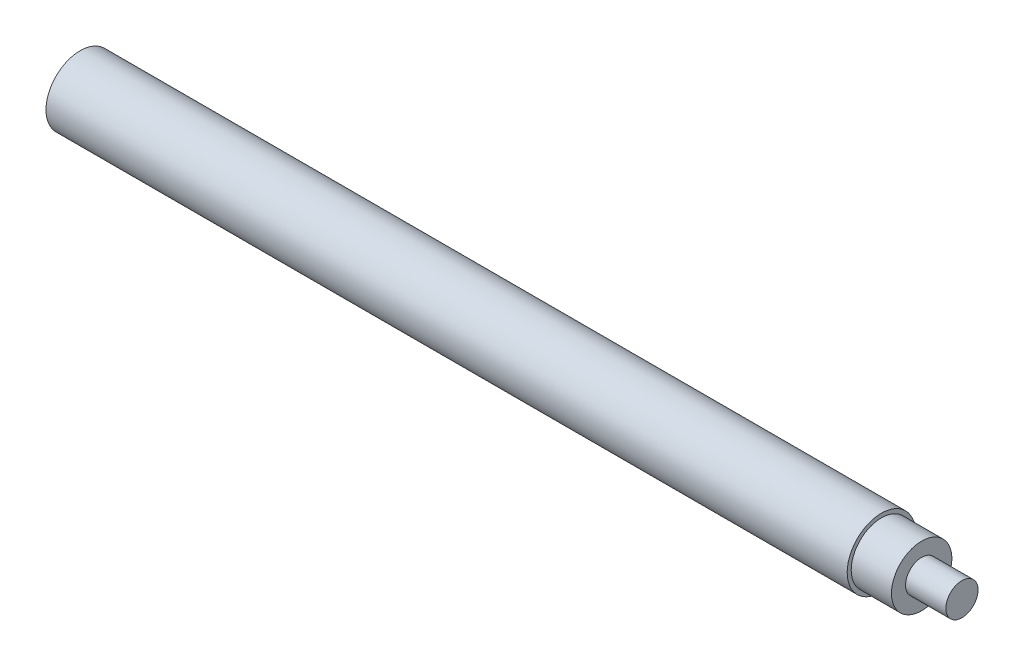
from build123d import *

# Parameters (mm, degrees)
SKETCH2_R      = 2.45
EXTRUDE1_DEPTH = 10


with BuildPart() as part:
    # Sketch1 → Revolve1 (revolve)
    with BuildSketch(Plane.XY, mode=Mode.PRIVATE) as revolve1_sk:
        Polygon((0, 0), (219, 0), (219, 4), (209, 4), (209, 7.5), (199, 7.5), (199, 8.5), (0, 8.5), align=None)
    revolve(revolve1_sk.sketch.rotate(Axis((0, 0, 0), (1, 0, 0)), 90), axis=Axis((0, 0, 0), (1, 0, 0)))

    # Sketch2 → Extrude1 (cut)
    with BuildSketch(Plane.ZY):
        Circle(SKETCH2_R)
    extrude(amount=-EXTRUDE1_DEPTH, mode=Mode.SUBTRACT)


solid = part.part
